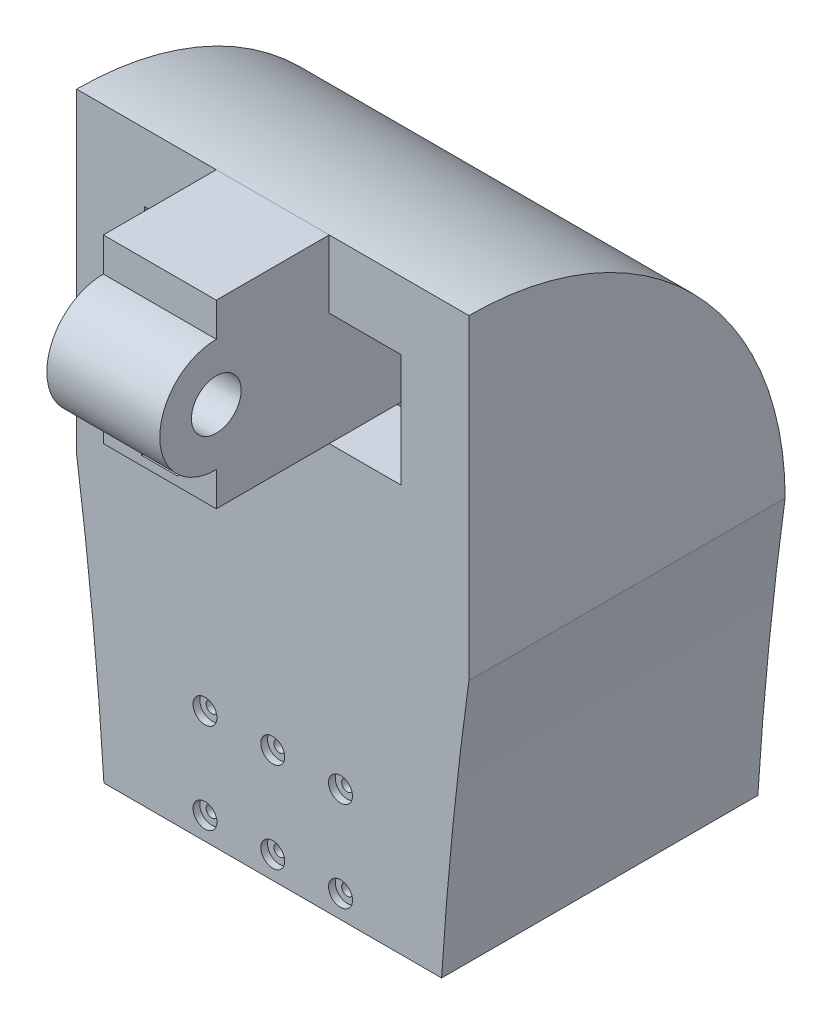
from build123d import *
from build123d.topology import SkipClean

# Parameters (mm, degrees)
SKETCH_2_W                = 200
SKETCH_2_H                = 113
SKETCH_2_W_2              = 140
SKETCH_2_H_2              = 60
EXTRUDE_2_DEPTH           = 90
SKETCH_4_W                = 200
SKETCH_4_H                = 90
CUT_EXTRUDE_2_DEPTH       = 3
SKETCH_5_R                = 1.5
CUT_EXTRUDE_3_DEPTH       = 222.585198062
SKETCH_6_W                = 200
SKETCH_6_H                = 30
EXTRUDE_4_DEPTH           = 50
EXTRUDE_5_DEPTH           = 130
EXTRUDE_5_2_DEPTH         = 130
EXTRUDE_6_DEPTH           = 10
CUT_EXTRUDE_START         = -150
CUT_EXTRUDE_8_DEPTH       = 150
CUT_EXTRUDE_9_DEPTH       = 140
SKETCH_17_W               = 1
SKETCH_17_H               = 140
EXTRUDE_9_DEPTH           = 10
EXTRUDE_10_DEPTH          = 172.641075
EXTRUDE_11_DEPTH          = 1
CUT_EXTRUDE_10_DEPTH      = 1
CUT_EXTRUDE_START_2       = -30
CUT_EXTRUDE_11_DEPTH      = 765.450264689
EXTRUDE_12_DEPTH          = 30
EXTRUDE_START             = -86.82
SKETCH_27_R               = 11
EXTRUDE_13_DEPTH          = 25
EXTRUDE_14_DEPTH          = 30
CUT_EXTRUDE_13_DEPTH      = 811.859223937
CUT_EXTRUDE_13_DEPTH_BACK = 25
SKETCH_30_R               = 2.5
CUT_EXTRUDE_14_DEPTH      = 10
EXTRUDE_15_DEPTH          = 30
SKETCH_33_R               = 2.5
CUT_EXTRUDE_15_DEPTH      = 25
CUT_EXTRUDE_16_DEPTH      = 10
SKETCH_35_W               = 140
SKETCH_35_H               = 60
CUT_EXTRUDE_17_DEPTH      = 170
CUT_EXTRUDE_18_DEPTH      = 795.916776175
CUT_EXTRUDE_18_DEPTH_BACK = 795.916776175
SKETCH_38_R               = 2.5
EXTRUDE_16_DEPTH          = 10
EXTRUDE_17_DEPTH          = 10
SKETCH_43_W               = 89.502844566
SKETCH_43_H               = 59.886240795
EXTRUDE_18_DEPTH          = 10
CUT_EXTRUDE_20_DEPTH      = 70
SKETCH_45_R               = 5.3
SKETCH_45_R_2             = 2.5
CUT_EXTRUDE_21_DEPTH      = 3
SKETCH_46_R               = 5.3
SKETCH_46_R_2             = 2.5
CUT_EXTRUDE_23_DEPTH      = 3
CUT_EXTRUDE_24_DEPTH      = 100
SKETCH_49_W               = 8
SKETCH_49_H               = 20
CUT_EXTRUDE_25_DEPTH      = 11


with BuildPart() as part:
    # Sketch 2 → Extrude 2 (new body)
    with BuildSketch(Plane.XY):
        with Locations((70, 53.5)):
            Rectangle(SKETCH_2_W, SKETCH_2_H)
        with Locations((70, 30)):
            Rectangle(SKETCH_2_W_2, SKETCH_2_H_2, mode=Mode.SUBTRACT)
    extrude(amount=EXTRUDE_2_DEPTH)

    # Sketch 4 → Cut-Extrude 2 (cut)
    with BuildSketch(Plane.XZ.offset(3)):
        with Locations((70, 45)):
            Rectangle(SKETCH_4_W, SKETCH_4_H)
    extrude(amount=-CUT_EXTRUDE_2_DEPTH, mode=Mode.SUBTRACT)

    # Sketch 5 → Cut-Extrude 3 (cut, through all)
    with BuildSketch(Plane(origin=(0, 110, 0), x_dir=(1, 0, 0), z_dir=(0, 1, 0))):
        with Locations(Location((132.5, -7.5, 0), (0, 0, 270))):
            Circle(SKETCH_5_R)
        with Locations(Location((112.5, -7.5, 0), (0, 0, 270))):
            Circle(SKETCH_5_R)
        with Locations(Location((112.5, -17.5, 0), (0, 0, 270))):
            Circle(SKETCH_5_R)
        with Locations(Location((132.5, -17.5, 0), (0, 0, 270))):
            Circle(SKETCH_5_R)
        with Locations(Location((27.5, -7.5, 0), (0, 0, 90))):
            Circle(SKETCH_5_R)
        with Locations(Location((7.5, -7.5, 0), (0, 0, 90))):
            Circle(SKETCH_5_R)
        with Locations(Location((7.5, -17.5, 0), (0, 0, 90))):
            Circle(SKETCH_5_R)
        with Locations(Location((27.5, -17.5, 0), (0, 0, 90))):
            Circle(SKETCH_5_R)
    extrude(amount=-CUT_EXTRUDE_3_DEPTH, mode=Mode.SUBTRACT)

    # Sketch 6 → Extrude 4 (add)
    with BuildSketch(Plane(origin=(0, 0, 0), x_dir=(-1, 0, 0), z_dir=(0, 0, -1))):
        with Locations((-70, 95)):
            Rectangle(SKETCH_6_W, SKETCH_6_H)
    extrude(amount=EXTRUDE_4_DEPTH)



with BuildPart() as body_2:
    # Sketch 7 → Extrude 5 (new body)
    with BuildSketch(Plane(origin=(0, 0, -50), x_dir=(-1, 0, 0), z_dir=(0, 0, -1))):
        with BuildLine():
            Line((-170, 110), (-140, 110))
            ThreePointArc((-140, 110), (-111.62336455, 410), (-140, 710))
            Line((-140, 710), (-170, 710))
            ThreePointArc((-170, 710), (-141.62336455, 410), (-170, 110))
        make_face()
    extrude(amount=-EXTRUDE_5_DEPTH)


with BuildPart() as body_3:
    # Sketch 7 → Extrude 5 2 (new body)
    with BuildSketch(Plane(origin=(0, 0, -50), x_dir=(-1, 0, 0), z_dir=(0, 0, -1))):
        with BuildLine():
            Line((0, 110), (30, 110))
            ThreePointArc((30, 110), (1.62336455, 410), (30, 710))
            Line((30, 710), (0, 710))
            ThreePointArc((0, 710), (-28.37663545, 410), (0, 110))
        make_face()
    extrude(amount=-EXTRUDE_5_2_DEPTH)


with BuildPart() as part_1:
    add(part.part)

    add(body_2.part)  # Extrude 6 merges body 2

    add(body_3.part)  # Extrude 6 merges body 3
    # Sketch 9 → Extrude 6 (add)
    with BuildSketch(Plane.XY.offset(80)):
        with BuildLine():
            Line((0, 710), (-30, 710))
            ThreePointArc((-30, 710), (-1.62336455, 410), (-30, 110))
            Line((-30, 110), (0, 110))
            ThreePointArc((0, 110), (28.37663545, 410), (0, 710))
        make_face()
        with BuildLine():
            Line((140, 110), (170, 110))
            ThreePointArc((170, 110), (141.62336455, 410), (170, 710))
            Line((170, 710), (140, 710))
            ThreePointArc((140, 710), (111.62336455, 410), (140, 110))
        make_face()
    extrude(amount=EXTRUDE_6_DEPTH)

    # Sketch 10 → Cut-Extrude 8 (cut)
    with BuildSketch(Plane.XY.offset(90).offset(CUT_EXTRUDE_START)):
        with BuildLine():
            Line((-305.360154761, 110), (-30, 110))
            ThreePointArc((-30, 110), (-6.974273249, 279.254921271), (-2.1234427, 450))
            Line((-2.1234427, 450), (-322.331444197, 450))
            Line((-322.331444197, 450), (-322.331444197, 110))
            Line((-322.331444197, 110), (-305.360154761, 110))
        make_face()
        with BuildLine():
            Line((0, 110), (70, 110))
            Line((70, 110), (70, 310))
            Line((70, 310), (70, 450))
            Line((70, 450), (27.8765573, 450))
            ThreePointArc((27.8765573, 450), (23.025726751, 279.254921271), (0, 110))
        make_face()
        with BuildLine():
            Line((70, 310), (70, 110))
            Line((70, 110), (140, 110))
            ThreePointArc((140, 110), (116.974273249, 279.254921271), (112.1234427, 450))
            Line((112.1234427, 450), (70, 450))
            Line((70, 450), (70, 310))
        make_face()
        with BuildLine():
            Line((-30, 110), (0, 110))
            ThreePointArc((0, 110), (23.025726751, 279.254921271), (27.8765573, 450))
            Line((27.8765573, 450), (-2.1234427, 450))
            ThreePointArc((-2.1234427, 450), (-6.974273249, 279.254921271), (-30, 110))
        make_face()
        with BuildLine():
            Line((140, 110), (70, 110))
            Line((70, 110), (70, 60))
            Line((70, 60), (140, 60))
            Line((140, 60), (140, 0))
            Line((140, 0), (170, 0))
            Line((170, 0), (170, 110))
            ThreePointArc((170, 110), (146.974273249, 279.254921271), (142.1234427, 450))
            Line((142.1234427, 450), (112.1234427, 450))
            ThreePointArc((112.1234427, 450), (116.974273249, 279.254921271), (140, 110))
        make_face()
        with BuildLine():
            Line((140, 60), (70, 60))
            Line((70, 60), (70, -23.16956805))
            Line((70, -23.16956805), (529.256566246, -23.16956805))
            Line((529.256566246, -23.16956805), (529.256566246, 450))
            Line((529.256566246, 450), (142.1234427, 450))
            ThreePointArc((142.1234427, 450), (146.974273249, 279.254921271), (170, 110))
            Line((170, 110), (170, 0))
            Line((170, 0), (140, 0))
            Line((140, 0), (140, 60))
        make_face()
        Polygon((70, 60), (70, 110), (0, 110), (-30, 110), (-30, 0), (0, 0), (0, 60), align=None)
    extrude(amount=CUT_EXTRUDE_8_DEPTH, mode=Mode.SUBTRACT)


with BuildPart() as cut_extrude_8_piece_1:
    # of the separate pieces the step leaves, piece 1, a body of its own (cut_extrude_8_pieces)
    add(part_1.part.solids().sort_by_distance((142.1234427, 450, 90))[0])


with BuildPart() as cut_extrude_8_piece_2:
    # of the separate pieces the step leaves, piece 2, a body of its own (cut_extrude_8_pieces)
    add(part_1.part.solids().sort_by_distance((0, 710, -50))[0])


with BuildPart() as cut_extrude_9_tool:
    # Sketch 11 → Cut-Extrude 9 (new body)
    with BuildSketch(Plane.XY.offset(90)):
        with BuildLine():
            Line((216.841438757, 710), (170, 710))
            ThreePointArc((170, 710), (162.903447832, 670.083495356), (156.820537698, 630))
            Line((156.820537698, 630), (216.841438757, 630))
            Line((216.841438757, 630), (216.841438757, 710))
        make_face()
        with BuildLine():
            Line((170, 710), (140, 710))
            ThreePointArc((140, 710), (132.903447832, 670.083495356), (126.820537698, 630))
            Line((126.820537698, 630), (156.820537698, 630))
            ThreePointArc((156.820537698, 630), (162.903447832, 670.083495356), (170, 710))
        make_face()
        with BuildLine():
            Line((140, 710), (0, 710))
            ThreePointArc((0, 710), (7.096552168, 670.083495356), (13.179462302, 630))
            Line((13.179462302, 630), (126.820537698, 630))
            ThreePointArc((126.820537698, 630), (132.903447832, 670.083495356), (140, 710))
        make_face()
        with BuildLine():
            Line((0, 710), (-30, 710))
            ThreePointArc((-30, 710), (-22.903447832, 670.083495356), (-16.820537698, 630))
            Line((-16.820537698, 630), (13.179462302, 630))
            ThreePointArc((13.179462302, 630), (7.096552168, 670.083495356), (0, 710))
        make_face()
    extrude(amount=-CUT_EXTRUDE_9_DEPTH)


with BuildPart() as cut_extrude_8_piece_1_1:
    add(cut_extrude_8_piece_1.part)

    # Cut-Extrude 9: cut by cut_extrude_9_tool
    add(cut_extrude_9_tool.part, mode=Mode.SUBTRACT)



with BuildPart() as cut_extrude_8_piece_2_1:
    add(cut_extrude_8_piece_2.part)

    # Cut-Extrude 9: cut by cut_extrude_9_tool
    add(cut_extrude_9_tool.part, mode=Mode.SUBTRACT)

    # Sketch 17 → Extrude 9 (add)
    with BuildSketch(Plane(origin=(0, 630, 0), x_dir=(1, 0, 0), z_dir=(0, 1, 0))):
        with Locations((-16.320537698, -20)):
            Rectangle(SKETCH_17_W, SKETCH_17_H)
    extrude(amount=EXTRUDE_9_DEPTH)



with BuildPart() as body_3_2:
    # Sketch 18 → Extrude 10 (new body)
    with BuildSketch(Plane(origin=(-15.820537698, 0, 0), x_dir=(0, 0, -1), z_dir=(1, 0, 0))):
        with BuildLine():
            ThreePointArc((49.642400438, 640), (5.393920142, 732.46950766), (-90, 770))
            Line((-90, 770), (-90, 640))
            Line((-90, 640), (49.642400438, 640))
        make_face()
        with BuildLine():
            Line((49.642400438, 640), (-90, 640))
            Line((-90, 640), (-90, 630))
            Line((-90, 630), (50, 630))
            ThreePointArc((50, 630), (49.910571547, 635.003195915), (49.642400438, 640))
        make_face()
    extrude(amount=EXTRUDE_10_DEPTH)


with BuildPart() as cut_extrude_8_piece_2_2:
    add(cut_extrude_8_piece_2_1.part)

    add(body_3_2.part)  # Extrude 11 merges body 3 2
    # Sketch 19 → Extrude 11 (add)
    with BuildSketch(Plane.ZY.offset(15.820537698)):
        with BuildLine():
            Line((90, 630), (90, 770))
            ThreePointArc((90, 770), (-8.994949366, 728.994949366), (-50, 630))
            Line((-50, 630), (90, 630))
        make_face()
    extrude(amount=EXTRUDE_11_DEPTH)

    # Sketch 21 → Cut-Extrude 10 (cut)
    with BuildSketch(Plane.ZY.offset(16.820537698)):
        with BuildLine():
            Line((-50, 640), (-50, 630))
            ThreePointArc((-50, 630), (-49.910571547, 635.003195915), (-49.642400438, 640))
            Line((-49.642400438, 640), (-50, 640))
        make_face()
    extrude(amount=-CUT_EXTRUDE_10_DEPTH, mode=Mode.SUBTRACT)

    # Sketch 22 → Cut-Extrude 11 (cut, through all)
    with BuildSketch(Plane.ZY.offset(16.820537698).offset(CUT_EXTRUDE_START_2)):
        with BuildLine():
            Line((90, 740), (90, 630))
            Line((90, 630), (-20, 630))
            ThreePointArc((-20, 630), (12.218254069, 707.781745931), (90, 740))
        make_face()
    extrude(amount=-CUT_EXTRUDE_11_DEPTH, mode=Mode.SUBTRACT)


with BuildPart() as cut_extrude_8_piece_1_2:
    add(cut_extrude_8_piece_1_1.part)

    add(cut_extrude_8_piece_2_2.part)  # Extrude 12 merges Cut-Extrude 8 piece 2
    # Sketch 26 → Extrude 12 (add)
    with BuildSketch(Plane(origin=(156.820537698, 0, 0), x_dir=(0, 0, -1), z_dir=(1, 0, 0))):
        with BuildLine():
            Line((-90, 630), (50, 630))
            ThreePointArc((50, 630), (8.994949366, 728.994949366), (-90, 770))
            Line((-90, 770), (-90, 630))
        make_face()
    extrude(amount=-EXTRUDE_12_DEPTH)

    # Sketch 27 → Extrude 13 (add, symmetric)
    with BuildSketch(Plane.ZY.offset(16.820537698).offset(EXTRUDE_START)):
        with BuildLine():
            Line((-36.491106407, 690), (140, 690))
            ThreePointArc((140, 690), (180, 730), (140, 770))
            Line((140, 770), (90, 770))
            ThreePointArc((90, 770), (15.166852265, 748.321595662), (-36.491106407, 690))
        make_face()
        with Locations((140, 730)):
            Circle(SKETCH_27_R, mode=Mode.SUBTRACT)
    extrude(amount=EXTRUDE_13_DEPTH, both=True)

    # Sketch 28 → Extrude 14 (add)
    with BuildSketch(Plane(origin=(0, 0, -50), x_dir=(-1, 0, 0), z_dir=(0, 0, -1))):
        with BuildLine():
            ThreePointArc((-112.1234427, 450), (-116.930290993, 540.207531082), (-126.820537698, 630))
            Line((-126.820537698, 630), (-13.179462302, 630))
            ThreePointArc((-13.179462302, 630), (-23.069709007, 540.207531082), (-27.8765573, 450))
            Line((-27.8765573, 450), (-112.1234427, 450))
        make_face()
    extrude(amount=-EXTRUDE_14_DEPTH)

    # Sketch 30 → Cut-Extrude 13 (cut, two sides: drawn at the far end of the back side and taken through both)
    with BuildSketch(Plane.XY.offset(-20).offset(-CUT_EXTRUDE_13_DEPTH_BACK)):
        with Locations(Location((40, 500, 0), (0, 0, 180))):
            Circle(SKETCH_30_R)
        with Locations(Location((70, 500, 0), (0, 0, 180))):
            Circle(SKETCH_30_R)
        with Locations(Location((100, 500, 0), (0, 0, 180))):
            Circle(SKETCH_30_R)
        with Locations(Location((70, 460, 0), (0, 0, 180))):
            Circle(SKETCH_30_R)
        with Locations(Location((100, 460, 0), (0, 0, 180))):
            Circle(SKETCH_30_R)
        with Locations(Location((40, 460, 0), (0, 0, 180))):
            Circle(SKETCH_30_R)
    extrude(amount=CUT_EXTRUDE_13_DEPTH + CUT_EXTRUDE_13_DEPTH_BACK, mode=Mode.SUBTRACT)

    # Sketch 31 → Cut-Extrude 14 (cut)
    with SkipClean():  # the faces are left unmerged after this step: merging them gives an invalid solid
        with BuildSketch(Plane.XY.offset(-20)):
            with BuildLine():
                Line((126.820537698, 630), (13.179462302, 630))
                ThreePointArc((13.179462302, 630), (23.069709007, 540.207531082), (27.8765573, 450))
                Line((27.8765573, 450), (112.1234427, 450))
                ThreePointArc((112.1234427, 450), (116.930290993, 540.207531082), (126.820537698, 630))
            make_face()
        extrude(amount=-CUT_EXTRUDE_14_DEPTH, mode=Mode.SUBTRACT)

    # Sketch 29 → Extrude 15 (add)
    with SkipClean():  # the faces are left unmerged after this step: merging them gives an invalid solid
        with BuildSketch(Plane.XY.offset(90)):
            with BuildLine():
                ThreePointArc((25.248577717, 510), (26.844111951, 480.012331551), (27.8765573, 450))
                Line((27.8765573, 450), (112.1234427, 450))
                ThreePointArc((112.1234427, 450), (113.155888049, 480.012331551), (114.751422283, 510))
                ThreePointArc((114.751422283, 510), (119.654902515, 570.113759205), (126.820537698, 630))
                Line((126.820537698, 630), (126.820537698, 690))
                Line((126.820537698, 690), (94.999462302, 690))
                Line((94.999462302, 690), (44.999462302, 690))
                Line((44.999462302, 690), (13.179462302, 690))
                Line((13.179462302, 690), (13.179462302, 630))
                ThreePointArc((13.179462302, 630), (20.345097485, 570.113759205), (25.248577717, 510))
            make_face()
        extrude(amount=-EXTRUDE_15_DEPTH)

    # Sketch 33 → Cut-Extrude 15 (cut)
    with SkipClean():  # the faces are left unmerged after this step: merging them gives an invalid solid
        with BuildSketch(Plane(origin=(0, 0, 60), x_dir=(-1, 0, 0), z_dir=(0, 0, -1))):
            with Locations(Location((-100, 460, 0), (0, 0, 180))):
                Circle(SKETCH_33_R)
            with Locations(Location((-100, 500, 0), (0, 0, 180))):
                Circle(SKETCH_33_R)
            with Locations(Location((-70, 500, 0), (0, 0, 180))):
                Circle(SKETCH_33_R)
            with Locations(Location((-70, 460, 0), (0, 0, 180))):
                Circle(SKETCH_33_R)
            with Locations(Location((-40, 460, 0), (0, 0, 180))):
                Circle(SKETCH_33_R)
            with Locations(Location((-40, 500, 0), (0, 0, 180))):
                Circle(SKETCH_33_R)
        extrude(amount=-CUT_EXTRUDE_15_DEPTH, mode=Mode.SUBTRACT)

    # Sketch 34 → Cut-Extrude 16 (cut)
    with SkipClean():  # the faces are left unmerged after this step: merging them gives an invalid solid
        with BuildSketch(Plane(origin=(0, 0, 60), x_dir=(-1, 0, 0), z_dir=(0, 0, -1))):
            with BuildLine():
                Line((-13.179462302, 630), (-126.820537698, 630))
                ThreePointArc((-126.820537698, 630), (-116.930290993, 540.207531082), (-112.1234427, 450))
                Line((-112.1234427, 450), (-27.8765573, 450))
                ThreePointArc((-27.8765573, 450), (-23.069709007, 540.207531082), (-13.179462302, 630))
            make_face()
        extrude(amount=-CUT_EXTRUDE_16_DEPTH, mode=Mode.SUBTRACT)

    # Sketch 35 → Cut-Extrude 17 (cut)
    with BuildSketch(Plane.ZY.offset(16.820537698)):
        with Locations((20, 480)):
            Rectangle(SKETCH_35_W, SKETCH_35_H)
    extrude(amount=-CUT_EXTRUDE_17_DEPTH, mode=Mode.SUBTRACT)

    # Sketch 38 → Cut-Extrude 18 (cut, two sides: drawn at the far end of the back side and taken through both)
    with BuildSketch(Plane(origin=(0, 0, 70), x_dir=(-1, 0, 0), z_dir=(0, 0, -1)).offset(-CUT_EXTRUDE_18_DEPTH_BACK)):
        with Locations((-100, 560)):
            Circle(SKETCH_38_R)
        with Locations((-70, 560)):
            Circle(SKETCH_38_R)
        with Locations((-40, 560)):
            Circle(SKETCH_38_R)
        with Locations((-70, 520)):
            Circle(SKETCH_38_R)
        with Locations((-40, 520)):
            Circle(SKETCH_38_R)
        with Locations((-100, 520)):
            Circle(SKETCH_38_R)
    extrude(amount=CUT_EXTRUDE_18_DEPTH + CUT_EXTRUDE_18_DEPTH_BACK, mode=Mode.SUBTRACT)

    # Sketch 40 → Extrude 16 (add)
    with BuildSketch(Plane(origin=(0, 0, 70), x_dir=(-1, 0, 0), z_dir=(0, 0, -1))):
        with BuildLine():
            ThreePointArc((-126.820537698, 630), (-119.654902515, 570.113759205), (-114.751422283, 510))
            Line((-114.751422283, 510), (-114.751422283, 630))
            Line((-114.751422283, 630), (-126.820537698, 630))
        make_face()
        with BuildLine():
            Line((-25.248577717, 630), (-25.248577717, 510))
            ThreePointArc((-25.248577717, 510), (-20.345097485, 570.113759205), (-13.179462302, 630))
            Line((-13.179462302, 630), (-25.248577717, 630))
        make_face()
    extrude(amount=EXTRUDE_16_DEPTH)

    # Sketch 42 → Extrude 17 (add)
    with BuildSketch(Plane(origin=(0, 0, 70), x_dir=(-1, 0, 0), z_dir=(0, 0, -1))):
        Polygon((-114.751422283, 570), (-70, 570), (-25.248577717, 570), (-25.248577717, 630), (-114.751422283, 630), align=None)
    extrude(amount=EXTRUDE_17_DEPTH)

    # Sketch 43 → Extrude 18 (add)
    with BuildSketch(Plane.XY.offset(-30)):
        with BuildLine():
            Line((20.345097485, 570.113759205), (25.248577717, 570.113759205))
            Line((25.248577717, 570.113759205), (25.248577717, 630))
            Line((25.248577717, 630), (13.179462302, 630))
            ThreePointArc((13.179462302, 630), (17.044488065, 600.090646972), (20.345097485, 570.113759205))
        make_face()
        with BuildLine():
            ThreePointArc((20.345097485, 570.113759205), (23.080117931, 540.079986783), (25.248577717, 510))
            Line((25.248577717, 510), (25.248577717, 570.113759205))
            Line((25.248577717, 570.113759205), (20.345097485, 570.113759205))
        make_face()
        with Locations((70, 600.056879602)):
            Rectangle(SKETCH_43_W, SKETCH_43_H)
        with BuildLine():
            Line((114.751422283, 630), (114.751422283, 570.113759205))
            Line((114.751422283, 570.113759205), (119.654902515, 570.113759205))
            ThreePointArc((119.654902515, 570.113759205), (122.955511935, 600.090646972), (126.820537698, 630))
            Line((126.820537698, 630), (114.751422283, 630))
        make_face()
        with BuildLine():
            Line((119.654902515, 570.113759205), (114.751422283, 570.113759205))
            Line((114.751422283, 570.113759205), (114.751422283, 510))
            ThreePointArc((114.751422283, 510), (116.919882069, 540.079986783), (119.654902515, 570.113759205))
        make_face()
    extrude(amount=EXTRUDE_18_DEPTH)

    # Sketch 44 → Cut-Extrude 20 (cut)
    with BuildSketch(Plane.ZY.offset(-44.999462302)):
        with BuildLine():
            ThreePointArc((140, 705), (165, 730), (140, 755))
            Line((140, 755), (140, 770))
            ThreePointArc((140, 770), (180, 730), (140, 690))
            Line((140, 690), (140, 705))
        make_face()
    extrude(amount=-CUT_EXTRUDE_20_DEPTH, mode=Mode.SUBTRACT)

    # Sketch 45 → Cut-Extrude 21 (cut)
    # profile 1 of 6: a face of its own
    with BuildSketch(Plane(origin=(0, 0, -50), x_dir=(-1, 0, 0), z_dir=(0, 0, -1))):
        with Locations((-100, 560)):
            Circle(SKETCH_45_R)
        with Locations((-100, 560)):
            Circle(SKETCH_45_R_2, mode=Mode.SUBTRACT)
    # profile 2 of 6: a face of its own
    with BuildSketch(Plane(origin=(0, 0, -50), x_dir=(-1, 0, 0), z_dir=(0, 0, -1))):
        with Locations((-70, 560)):
            Circle(SKETCH_45_R)
        with Locations((-70, 560)):
            Circle(SKETCH_45_R_2, mode=Mode.SUBTRACT)
    # profile 3 of 6: a face of its own
    with BuildSketch(Plane(origin=(0, 0, -50), x_dir=(-1, 0, 0), z_dir=(0, 0, -1))):
        with Locations((-40, 560)):
            Circle(SKETCH_45_R)
        with Locations((-40, 560)):
            Circle(SKETCH_45_R_2, mode=Mode.SUBTRACT)
    # profile 4 of 6: a face of its own
    with BuildSketch(Plane(origin=(0, 0, -50), x_dir=(-1, 0, 0), z_dir=(0, 0, -1))):
        with Locations((-40, 520)):
            Circle(SKETCH_45_R)
        with Locations((-40, 520)):
            Circle(SKETCH_45_R_2, mode=Mode.SUBTRACT)
    # profile 5 of 6: a face of its own
    with BuildSketch(Plane(origin=(0, 0, -50), x_dir=(-1, 0, 0), z_dir=(0, 0, -1))):
        with Locations((-70, 520)):
            Circle(SKETCH_45_R)
        with Locations((-70, 520)):
            Circle(SKETCH_45_R_2, mode=Mode.SUBTRACT)
    # profile 6 of 6: a face of its own
    with BuildSketch(Plane(origin=(0, 0, -50), x_dir=(-1, 0, 0), z_dir=(0, 0, -1))):
        with Locations((-100, 520)):
            Circle(SKETCH_45_R)
        with Locations((-100, 520)):
            Circle(SKETCH_45_R_2, mode=Mode.SUBTRACT)
    extrude(amount=-CUT_EXTRUDE_21_DEPTH, mode=Mode.SUBTRACT)

    # Sketch 46 → Cut-Extrude 23 (cut)
    # profile 1 of 6: a face of its own
    with BuildSketch(Plane.XY.offset(90)):
        with Locations(Location((40, 560, 0), (0, 0, 180))):
            Circle(SKETCH_46_R)
        with Locations(Location((40, 560, 0), (0, 0, 180))):
            Circle(SKETCH_46_R_2, mode=Mode.SUBTRACT)
    # profile 2 of 6: a face of its own
    with BuildSketch(Plane.XY.offset(90)):
        with Locations(Location((70, 560, 0), (0, 0, 180))):
            Circle(SKETCH_46_R)
        with Locations(Location((70, 560, 0), (0, 0, 180))):
            Circle(SKETCH_46_R_2, mode=Mode.SUBTRACT)
    # profile 3 of 6: a face of its own
    with BuildSketch(Plane.XY.offset(90)):
        with Locations(Location((100, 560, 0), (0, 0, 180))):
            Circle(SKETCH_46_R)
        with Locations(Location((100, 560, 0), (0, 0, 180))):
            Circle(SKETCH_46_R_2, mode=Mode.SUBTRACT)
    # profile 4 of 6: a face of its own
    with BuildSketch(Plane.XY.offset(90)):
        with Locations(Location((100, 520, 0), (0, 0, 180))):
            Circle(SKETCH_46_R)
        with Locations(Location((100, 520, 0), (0, 0, 180))):
            Circle(SKETCH_46_R_2, mode=Mode.SUBTRACT)
    # profile 5 of 6: a face of its own
    with BuildSketch(Plane.XY.offset(90)):
        with Locations(Location((70, 520, 0), (0, 0, 180))):
            Circle(SKETCH_46_R)
        with Locations(Location((70, 520, 0), (0, 0, 180))):
            Circle(SKETCH_46_R_2, mode=Mode.SUBTRACT)
    # profile 6 of 6: a face of its own
    with BuildSketch(Plane.XY.offset(90)):
        with Locations(Location((40, 520, 0), (0, 0, 180))):
            Circle(SKETCH_46_R)
        with Locations(Location((40, 520, 0), (0, 0, 180))):
            Circle(SKETCH_46_R_2, mode=Mode.SUBTRACT)
    extrude(amount=-CUT_EXTRUDE_23_DEPTH, mode=Mode.SUBTRACT)

    # Sketch 48 → Cut-Extrude 24 (cut)
    with BuildSketch(Plane.XY.offset(140)):
        Polygon((77.999462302, 694), (69.999462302, 694), (61.999462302, 694), (61.999462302, 701), (77.999462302, 701), align=None)
    extrude(amount=-CUT_EXTRUDE_24_DEPTH, mode=Mode.SUBTRACT)

    # Sketch 49 → Cut-Extrude 25 (cut)
    with BuildSketch(Plane.XZ.offset(-690)):
        with Locations((73.999462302, 50)):
            Rectangle(SKETCH_49_W, SKETCH_49_H)
        with Locations((65.999462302, 50)):
            Rectangle(SKETCH_49_W, SKETCH_49_H)
    extrude(amount=-CUT_EXTRUDE_25_DEPTH, mode=Mode.SUBTRACT)


solid = cut_extrude_8_piece_1_2.part
